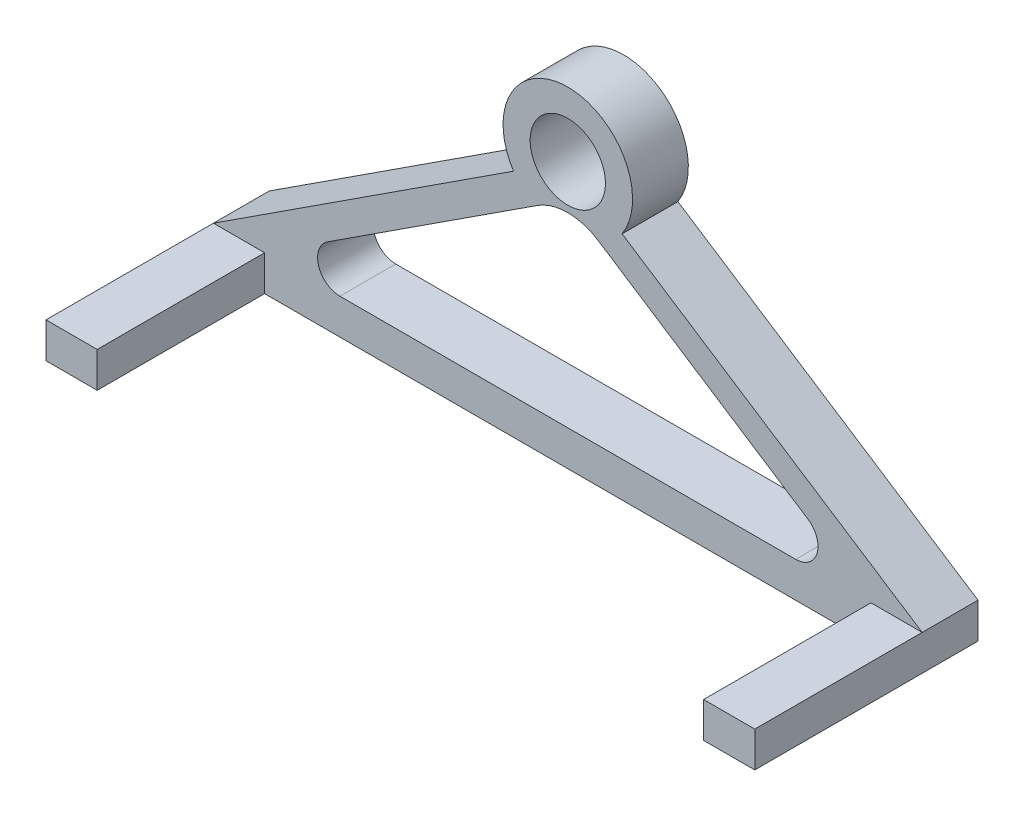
ISO-10303-21;
HEADER;
FILE_DESCRIPTION(('STEP AP214'),'2;1');
FILE_NAME('part.step','',(''),(''),'','','');
FILE_SCHEMA(('AUTOMOTIVE_DESIGN { 1 0 10303 214 1 1 1 1 }'));
ENDSEC;
DATA;
#1=APPLICATION_CONTEXT('core data for automotive mechanical design processes');
#2=APPLICATION_PROTOCOL_DEFINITION('international standard','automotive_design',2000,#1);
#3=PRODUCT_CONTEXT('',#1,'mechanical');
#4=PRODUCT('Part','Part','',(#3));
#5=PRODUCT_RELATED_PRODUCT_CATEGORY('part','',(#4));
#6=PRODUCT_DEFINITION_FORMATION('','',#4);
#7=PRODUCT_DEFINITION_CONTEXT('part definition',#1,'design');
#8=PRODUCT_DEFINITION('design','',#6,#7);
#9=PRODUCT_DEFINITION_SHAPE('','',#8);
#10=(LENGTH_UNIT() NAMED_UNIT(*) SI_UNIT(.MILLI.,.METRE.));
#11=(NAMED_UNIT(*) PLANE_ANGLE_UNIT() SI_UNIT($,.RADIAN.));
#12=(NAMED_UNIT(*) SI_UNIT($,.STERADIAN.) SOLID_ANGLE_UNIT());
#13=UNCERTAINTY_MEASURE_WITH_UNIT(LENGTH_MEASURE(1.E-05),#10,'distance_accuracy_value','');
#14=(GEOMETRIC_REPRESENTATION_CONTEXT(3) GLOBAL_UNCERTAINTY_ASSIGNED_CONTEXT((#13)) GLOBAL_UNIT_ASSIGNED_CONTEXT((#10,
#11,#12)) REPRESENTATION_CONTEXT('',''));
#15=CARTESIAN_POINT('',(0.,0.,0.));
#16=DIRECTION('',(0.,0.,1.));
#17=DIRECTION('',(1.,0.,0.));
#18=AXIS2_PLACEMENT_3D('',#15,#16,#17);
#19=CARTESIAN_POINT('',(0.,47.63,10.));
#20=DIRECTION('',(0.,0.,1.));
#21=DIRECTION('',(1.,0.,0.));
#22=AXIS2_PLACEMENT_3D('',#19,#20,#21);
#23=PLANE('',#22);
#24=DIRECTION('',(-1.,0.,0.));
#25=VECTOR('',#24,1.);
#26=CARTESIAN_POINT('',(-63.5,6.35,10.));
#27=LINE('',#26,#25);
#28=CARTESIAN_POINT('',(-54.3262731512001,6.35,10.));
#29=VERTEX_POINT('',#28);
#30=CARTESIAN_POINT('',(-63.5,6.35,10.));
#31=VERTEX_POINT('',#30);
#32=EDGE_CURVE('E195',#29,#31,#27,.T.);
#33=ORIENTED_EDGE('',*,*,#32,.F.);
#34=DIRECTION('',(0.,1.,0.));
#35=VECTOR('',#34,1.);
#36=CARTESIAN_POINT('',(-54.3262731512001,0.,10.));
#37=LINE('',#36,#35);
#38=CARTESIAN_POINT('',(-54.3262731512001,0.,10.));
#39=VERTEX_POINT('',#38);
#40=EDGE_CURVE('E164',#39,#29,#37,.T.);
#41=ORIENTED_EDGE('',*,*,#40,.F.);
#42=DIRECTION('',(1.,0.,0.));
#43=VECTOR('',#42,1.);
#44=CARTESIAN_POINT('',(-63.5,0.,10.));
#45=LINE('',#44,#43);
#46=CARTESIAN_POINT('',(54.3262731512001,0.,10.));
#47=VERTEX_POINT('',#46);
#48=EDGE_CURVE('E245',#39,#47,#45,.T.);
#49=ORIENTED_EDGE('',*,*,#48,.T.);
#50=DIRECTION('',(0.,1.,0.));
#51=VECTOR('',#50,1.);
#52=CARTESIAN_POINT('',(54.3262731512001,0.,10.));
#53=LINE('',#52,#51);
#54=CARTESIAN_POINT('',(54.3262731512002,6.34999999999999,10.));
#55=VERTEX_POINT('',#54);
#56=EDGE_CURVE('E175',#47,#55,#53,.T.);
#57=ORIENTED_EDGE('',*,*,#56,.T.);
#58=DIRECTION('',(1.,0.,0.));
#59=VECTOR('',#58,1.);
#60=CARTESIAN_POINT('',(63.5,6.35,10.));
#61=LINE('',#60,#59);
#62=CARTESIAN_POINT('',(63.5,6.35,10.));
#63=VERTEX_POINT('',#62);
#64=EDGE_CURVE('E185',#55,#63,#61,.T.);
#65=ORIENTED_EDGE('',*,*,#64,.T.);
#66=DIRECTION('',(-0.83841344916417,0.545034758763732,0.));
#67=VECTOR('',#66,1.);
#68=CARTESIAN_POINT('',(9.72559601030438,41.3075967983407,10.));
#69=LINE('',#68,#67);
#70=CARTESIAN_POINT('',(9.72559601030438,41.3075967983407,10.));
#71=VERTEX_POINT('',#70);
#72=EDGE_CURVE('E242',#63,#71,#69,.T.);
#73=ORIENTED_EDGE('',*,*,#72,.T.);
#74=CARTESIAN_POINT('',(0.,47.63,10.));
#75=DIRECTION('',(0.,0.,1.));
#76=DIRECTION('',(1.,0.,0.));
#77=AXIS2_PLACEMENT_3D('',#74,#75,#76);
#78=CIRCLE('',#77,11.6);
#79=CARTESIAN_POINT('',(-9.72559601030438,41.3075967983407,10.));
#80=VERTEX_POINT('',#79);
#81=EDGE_CURVE('E534',#71,#80,#78,.T.);
#82=ORIENTED_EDGE('',*,*,#81,.T.);
#83=DIRECTION('',(-0.83841344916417,-0.545034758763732,0.));
#84=VECTOR('',#83,1.);
#85=CARTESIAN_POINT('',(-9.72559601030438,41.3075967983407,10.));
#86=LINE('',#85,#84);
#87=EDGE_CURVE('E523',#80,#31,#86,.T.);
#88=ORIENTED_EDGE('',*,*,#87,.T.);
#89=EDGE_LOOP('',(#33,#41,#49,#57,#65,#73,#82,#88));
#90=FACE_BOUND('',#89,.T.);
#91=CARTESIAN_POINT('',(-40.8341908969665,10.35,10.));
#92=DIRECTION('',(0.,0.,1.));
#93=DIRECTION('',(1.,0.,0.));
#94=AXIS2_PLACEMENT_3D('',#91,#92,#93);
#95=CIRCLE('',#94,4.);
#96=CARTESIAN_POINT('',(-40.8341908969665,6.35,10.));
#97=VERTEX_POINT('',#96);
#98=CARTESIAN_POINT('',(-43.0143299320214,13.7036537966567,10.));
#99=VERTEX_POINT('',#98);
#100=EDGE_CURVE('E11',#97,#99,#95,.F.);
#101=ORIENTED_EDGE('',*,*,#100,.T.);
#102=DIRECTION('',(-0.83841344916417,-0.545034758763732,0.));
#103=VECTOR('',#102,1.);
#104=CARTESIAN_POINT('',(-5.45034758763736,38.1232001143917,10.));
#105=LINE('',#104,#103);
#106=CARTESIAN_POINT('',(-5.45034758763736,38.1232001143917,10.));
#107=VERTEX_POINT('',#106);
#108=EDGE_CURVE('E45',#107,#99,#105,.T.);
#109=ORIENTED_EDGE('',*,*,#108,.F.);
#110=CARTESIAN_POINT('',(0.,29.73906562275,10.));
#111=DIRECTION('',(0.,0.,1.));
#112=DIRECTION('',(1.,0.,0.));
#113=AXIS2_PLACEMENT_3D('',#110,#111,#112);
#114=CIRCLE('',#113,10.);
#115=CARTESIAN_POINT('',(5.45034758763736,38.1232001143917,10.));
#116=VERTEX_POINT('',#115);
#117=EDGE_CURVE('E217',#116,#107,#114,.T.);
#118=ORIENTED_EDGE('',*,*,#117,.F.);
#119=DIRECTION('',(-0.83841344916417,0.545034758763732,0.));
#120=VECTOR('',#119,1.);
#121=CARTESIAN_POINT('',(5.45034758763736,38.1232001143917,10.));
#122=LINE('',#121,#120);
#123=CARTESIAN_POINT('',(43.0143299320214,13.7036537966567,10.));
#124=VERTEX_POINT('',#123);
#125=EDGE_CURVE('E222',#124,#116,#122,.T.);
#126=ORIENTED_EDGE('',*,*,#125,.F.);
#127=CARTESIAN_POINT('',(40.8341908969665,10.35,10.));
#128=DIRECTION('',(0.,0.,1.));
#129=DIRECTION('',(1.,0.,0.));
#130=AXIS2_PLACEMENT_3D('',#127,#128,#129);
#131=CIRCLE('',#130,4.);
#132=CARTESIAN_POINT('',(40.8341908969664,6.34999999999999,10.));
#133=VERTEX_POINT('',#132);
#134=EDGE_CURVE('E269',#124,#133,#131,.F.);
#135=ORIENTED_EDGE('',*,*,#134,.T.);
#136=DIRECTION('',(1.,0.,0.));
#137=VECTOR('',#136,1.);
#138=CARTESIAN_POINT('',(-54.3262731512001,6.35,10.));
#139=LINE('',#138,#137);
#140=EDGE_CURVE('E52',#97,#133,#139,.T.);
#141=ORIENTED_EDGE('',*,*,#140,.F.);
#142=EDGE_LOOP('',(#101,#109,#118,#126,#135,#141));
#143=FACE_BOUND('',#142,.T.);
#144=CARTESIAN_POINT('',(0.,47.63,10.));
#145=DIRECTION('',(0.,0.,1.));
#146=DIRECTION('',(1.,0.,0.));
#147=AXIS2_PLACEMENT_3D('',#144,#145,#146);
#148=CIRCLE('',#147,6.745);
#149=CARTESIAN_POINT('',(6.745,47.63,10.));
#150=VERTEX_POINT('',#149);
#151=EDGE_CURVE('E210',#150,#150,#148,.T.);
#152=ORIENTED_EDGE('',*,*,#151,.F.);
#153=EDGE_LOOP('',(#152));
#154=FACE_BOUND('',#153,.T.);
#155=ADVANCED_FACE('F30',(#90,#143,#154),#23,.T.);
#156=CARTESIAN_POINT('',(0.,47.63,0.));
#157=DIRECTION('',(0.,0.,1.));
#158=DIRECTION('',(1.,0.,0.));
#159=AXIS2_PLACEMENT_3D('',#156,#157,#158);
#160=PLANE('',#159);
#161=CARTESIAN_POINT('',(0.,29.73906562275,0.));
#162=DIRECTION('',(0.,0.,1.));
#163=DIRECTION('',(1.,0.,0.));
#164=AXIS2_PLACEMENT_3D('',#161,#162,#163);
#165=CIRCLE('',#164,10.);
#166=CARTESIAN_POINT('',(5.45034758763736,38.1232001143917,0.));
#167=VERTEX_POINT('',#166);
#168=CARTESIAN_POINT('',(-5.45034758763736,38.1232001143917,0.));
#169=VERTEX_POINT('',#168);
#170=EDGE_CURVE('E213',#167,#169,#165,.T.);
#171=ORIENTED_EDGE('',*,*,#170,.T.);
#172=DIRECTION('',(-0.83841344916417,-0.545034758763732,0.));
#173=VECTOR('',#172,1.);
#174=CARTESIAN_POINT('',(-5.45034758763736,38.1232001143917,0.));
#175=LINE('',#174,#173);
#176=CARTESIAN_POINT('',(-43.0143299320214,13.7036537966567,0.));
#177=VERTEX_POINT('',#176);
#178=EDGE_CURVE('E227',#169,#177,#175,.T.);
#179=ORIENTED_EDGE('',*,*,#178,.T.);
#180=CARTESIAN_POINT('',(-40.8341908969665,10.35,0.));
#181=DIRECTION('',(0.,0.,1.));
#182=DIRECTION('',(1.,0.,0.));
#183=AXIS2_PLACEMENT_3D('',#180,#181,#182);
#184=CIRCLE('',#183,4.);
#185=CARTESIAN_POINT('',(-40.8341908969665,6.35,0.));
#186=VERTEX_POINT('',#185);
#187=EDGE_CURVE('E38',#177,#186,#184,.T.);
#188=ORIENTED_EDGE('',*,*,#187,.T.);
#189=DIRECTION('',(1.,0.,0.));
#190=VECTOR('',#189,1.);
#191=CARTESIAN_POINT('',(-54.3262731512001,6.35,0.));
#192=LINE('',#191,#190);
#193=CARTESIAN_POINT('',(40.8341908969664,6.34999999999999,0.));
#194=VERTEX_POINT('',#193);
#195=EDGE_CURVE('E230',#186,#194,#192,.T.);
#196=ORIENTED_EDGE('',*,*,#195,.T.);
#197=CARTESIAN_POINT('',(40.8341908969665,10.35,0.));
#198=DIRECTION('',(0.,0.,1.));
#199=DIRECTION('',(1.,0.,0.));
#200=AXIS2_PLACEMENT_3D('',#197,#198,#199);
#201=CIRCLE('',#200,4.);
#202=CARTESIAN_POINT('',(43.0143299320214,13.7036537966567,0.));
#203=VERTEX_POINT('',#202);
#204=EDGE_CURVE('E267',#194,#203,#201,.T.);
#205=ORIENTED_EDGE('',*,*,#204,.T.);
#206=DIRECTION('',(-0.83841344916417,0.545034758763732,0.));
#207=VECTOR('',#206,1.);
#208=CARTESIAN_POINT('',(5.45034758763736,38.1232001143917,0.));
#209=LINE('',#208,#207);
#210=EDGE_CURVE('E219',#203,#167,#209,.T.);
#211=ORIENTED_EDGE('',*,*,#210,.T.);
#212=EDGE_LOOP('',(#171,#179,#188,#196,#205,#211));
#213=FACE_BOUND('',#212,.T.);
#214=DIRECTION('',(0.,-1.,0.));
#215=VECTOR('',#214,1.);
#216=CARTESIAN_POINT('',(-63.5,6.35,0.));
#217=LINE('',#216,#215);
#218=CARTESIAN_POINT('',(-63.5,6.35,0.));
#219=VERTEX_POINT('',#218);
#220=CARTESIAN_POINT('',(-63.5,0.,0.));
#221=VERTEX_POINT('',#220);
#222=EDGE_CURVE('E239',#219,#221,#217,.T.);
#223=ORIENTED_EDGE('',*,*,#222,.F.);
#224=DIRECTION('',(-0.83841344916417,-0.545034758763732,0.));
#225=VECTOR('',#224,1.);
#226=CARTESIAN_POINT('',(-9.72559601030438,41.3075967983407,0.));
#227=LINE('',#226,#225);
#228=CARTESIAN_POINT('',(-9.72559601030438,41.3075967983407,0.));
#229=VERTEX_POINT('',#228);
#230=EDGE_CURVE('E248',#229,#219,#227,.T.);
#231=ORIENTED_EDGE('',*,*,#230,.F.);
#232=CARTESIAN_POINT('',(0.,47.63,0.));
#233=DIRECTION('',(0.,0.,1.));
#234=DIRECTION('',(1.,0.,0.));
#235=AXIS2_PLACEMENT_3D('',#232,#233,#234);
#236=CIRCLE('',#235,11.6);
#237=CARTESIAN_POINT('',(9.72559601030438,41.3075967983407,0.));
#238=VERTEX_POINT('',#237);
#239=EDGE_CURVE('E525',#238,#229,#236,.T.);
#240=ORIENTED_EDGE('',*,*,#239,.F.);
#241=DIRECTION('',(-0.83841344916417,0.545034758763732,0.));
#242=VECTOR('',#241,1.);
#243=CARTESIAN_POINT('',(9.72559601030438,41.3075967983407,0.));
#244=LINE('',#243,#242);
#245=CARTESIAN_POINT('',(63.5,6.35,0.));
#246=VERTEX_POINT('',#245);
#247=EDGE_CURVE('E527',#246,#238,#244,.T.);
#248=ORIENTED_EDGE('',*,*,#247,.F.);
#249=DIRECTION('',(0.,1.,0.));
#250=VECTOR('',#249,1.);
#251=CARTESIAN_POINT('',(63.5,6.35,0.));
#252=LINE('',#251,#250);
#253=CARTESIAN_POINT('',(63.5,0.,0.));
#254=VERTEX_POINT('',#253);
#255=EDGE_CURVE('E529',#254,#246,#252,.T.);
#256=ORIENTED_EDGE('',*,*,#255,.F.);
#257=DIRECTION('',(1.,0.,0.));
#258=VECTOR('',#257,1.);
#259=CARTESIAN_POINT('',(-63.5,0.,0.));
#260=LINE('',#259,#258);
#261=EDGE_CURVE('E510',#221,#254,#260,.T.);
#262=ORIENTED_EDGE('',*,*,#261,.F.);
#263=EDGE_LOOP('',(#223,#231,#240,#248,#256,#262));
#264=FACE_BOUND('',#263,.T.);
#265=CARTESIAN_POINT('',(0.,47.63,0.));
#266=DIRECTION('',(0.,0.,1.));
#267=DIRECTION('',(1.,0.,0.));
#268=AXIS2_PLACEMENT_3D('',#265,#266,#267);
#269=CIRCLE('',#268,6.745);
#270=CARTESIAN_POINT('',(6.745,47.63,0.));
#271=VERTEX_POINT('',#270);
#272=EDGE_CURVE('E214',#271,#271,#269,.T.);
#273=ORIENTED_EDGE('',*,*,#272,.T.);
#274=EDGE_LOOP('',(#273));
#275=FACE_BOUND('',#274,.T.);
#276=ADVANCED_FACE('F272',(#213,#264,#275),#160,.F.);
#277=CARTESIAN_POINT('',(-63.5,6.35,10.));
#278=DIRECTION('',(1.,0.,0.));
#279=DIRECTION('',(0.,0.,-1.));
#280=AXIS2_PLACEMENT_3D('',#277,#278,#279);
#281=PLANE('',#280);
#282=ORIENTED_EDGE('',*,*,#222,.T.);
#283=DIRECTION('',(0.,0.,-1.));
#284=VECTOR('',#283,1.);
#285=CARTESIAN_POINT('',(-63.5,0.,10.));
#286=LINE('',#285,#284);
#287=CARTESIAN_POINT('',(-63.5,0.,40.));
#288=VERTEX_POINT('',#287);
#289=EDGE_CURVE('E249',#288,#221,#286,.T.);
#290=ORIENTED_EDGE('',*,*,#289,.F.);
#291=DIRECTION('',(0.,-1.,0.));
#292=VECTOR('',#291,1.);
#293=CARTESIAN_POINT('',(-63.5,0.,40.));
#294=LINE('',#293,#292);
#295=CARTESIAN_POINT('',(-63.5,6.35,40.));
#296=VERTEX_POINT('',#295);
#297=EDGE_CURVE('E191',#296,#288,#294,.T.);
#298=ORIENTED_EDGE('',*,*,#297,.F.);
#299=DIRECTION('',(0.,0.,-1.));
#300=VECTOR('',#299,1.);
#301=CARTESIAN_POINT('',(-63.5,6.35,40.));
#302=LINE('',#301,#300);
#303=EDGE_CURVE('E201',#296,#31,#302,.T.);
#304=ORIENTED_EDGE('',*,*,#303,.T.);
#305=DIRECTION('',(0.,0.,-1.));
#306=VECTOR('',#305,1.);
#307=CARTESIAN_POINT('',(-63.5,6.35,10.));
#308=LINE('',#307,#306);
#309=EDGE_CURVE('E520',#31,#219,#308,.T.);
#310=ORIENTED_EDGE('',*,*,#309,.T.);
#311=EDGE_LOOP('',(#282,#290,#298,#304,#310));
#312=FACE_BOUND('',#311,.T.);
#313=ADVANCED_FACE('F311',(#312),#281,.F.);
#314=CARTESIAN_POINT('',(-63.5,0.,10.));
#315=DIRECTION('',(0.,1.,0.));
#316=DIRECTION('',(0.,0.,1.));
#317=AXIS2_PLACEMENT_3D('',#314,#315,#316);
#318=PLANE('',#317);
#319=ORIENTED_EDGE('',*,*,#261,.T.);
#320=DIRECTION('',(0.,0.,-1.));
#321=VECTOR('',#320,1.);
#322=CARTESIAN_POINT('',(63.5,0.,10.));
#323=LINE('',#322,#321);
#324=CARTESIAN_POINT('',(63.5,0.,40.));
#325=VERTEX_POINT('',#324);
#326=EDGE_CURVE('E509',#325,#254,#323,.T.);
#327=ORIENTED_EDGE('',*,*,#326,.F.);
#328=DIRECTION('',(-1.,0.,0.));
#329=VECTOR('',#328,1.);
#330=CARTESIAN_POINT('',(63.5,0.,40.));
#331=LINE('',#330,#329);
#332=CARTESIAN_POINT('',(54.3262731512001,0.,40.));
#333=VERTEX_POINT('',#332);
#334=EDGE_CURVE('E174',#325,#333,#331,.T.);
#335=ORIENTED_EDGE('',*,*,#334,.T.);
#336=DIRECTION('',(0.,0.,-1.));
#337=VECTOR('',#336,1.);
#338=CARTESIAN_POINT('',(54.3262731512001,0.,40.));
#339=LINE('',#338,#337);
#340=EDGE_CURVE('E184',#333,#47,#339,.T.);
#341=ORIENTED_EDGE('',*,*,#340,.T.);
#342=ORIENTED_EDGE('',*,*,#48,.F.);
#343=DIRECTION('',(0.,0.,-1.));
#344=VECTOR('',#343,1.);
#345=CARTESIAN_POINT('',(-54.3262731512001,0.,40.));
#346=LINE('',#345,#344);
#347=CARTESIAN_POINT('',(-54.3262731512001,0.,40.));
#348=VERTEX_POINT('',#347);
#349=EDGE_CURVE('E209',#348,#39,#346,.T.);
#350=ORIENTED_EDGE('',*,*,#349,.F.);
#351=DIRECTION('',(1.,0.,0.));
#352=VECTOR('',#351,1.);
#353=CARTESIAN_POINT('',(-63.5,0.,40.));
#354=LINE('',#353,#352);
#355=EDGE_CURVE('E194',#288,#348,#354,.T.);
#356=ORIENTED_EDGE('',*,*,#355,.F.);
#357=ORIENTED_EDGE('',*,*,#289,.T.);
#358=EDGE_LOOP('',(#319,#327,#335,#341,#342,#350,#356,#357));
#359=FACE_BOUND('',#358,.T.);
#360=ADVANCED_FACE('F327',(#359),#318,.F.);
#361=CARTESIAN_POINT('',(63.5,6.35,10.));
#362=DIRECTION('',(-1.,0.,0.));
#363=DIRECTION('',(0.,0.,1.));
#364=AXIS2_PLACEMENT_3D('',#361,#362,#363);
#365=PLANE('',#364);
#366=ORIENTED_EDGE('',*,*,#255,.T.);
#367=DIRECTION('',(0.,0.,-1.));
#368=VECTOR('',#367,1.);
#369=CARTESIAN_POINT('',(63.5,6.35,10.));
#370=LINE('',#369,#368);
#371=EDGE_CURVE('E159',#63,#246,#370,.T.);
#372=ORIENTED_EDGE('',*,*,#371,.F.);
#373=DIRECTION('',(0.,0.,-1.));
#374=VECTOR('',#373,1.);
#375=CARTESIAN_POINT('',(63.5,6.35,40.));
#376=LINE('',#375,#374);
#377=CARTESIAN_POINT('',(63.5,6.35,40.));
#378=VERTEX_POINT('',#377);
#379=EDGE_CURVE('E152',#378,#63,#376,.T.);
#380=ORIENTED_EDGE('',*,*,#379,.F.);
#381=DIRECTION('',(0.,-1.,0.));
#382=VECTOR('',#381,1.);
#383=CARTESIAN_POINT('',(63.5,0.,40.));
#384=LINE('',#383,#382);
#385=EDGE_CURVE('E156',#378,#325,#384,.T.);
#386=ORIENTED_EDGE('',*,*,#385,.T.);
#387=ORIENTED_EDGE('',*,*,#326,.T.);
#388=EDGE_LOOP('',(#366,#372,#380,#386,#387));
#389=FACE_BOUND('',#388,.T.);
#390=ADVANCED_FACE('F154',(#389),#365,.F.);
#391=CARTESIAN_POINT('',(9.72559601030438,41.3075967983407,10.));
#392=DIRECTION('',(-0.545034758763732,-0.83841344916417,0.));
#393=DIRECTION('',(0.83841344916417,-0.545034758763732,0.));
#394=AXIS2_PLACEMENT_3D('',#391,#392,#393);
#395=PLANE('',#394);
#396=ORIENTED_EDGE('',*,*,#247,.T.);
#397=DIRECTION('',(0.,0.,-1.));
#398=VECTOR('',#397,1.);
#399=CARTESIAN_POINT('',(9.72559601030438,41.3075967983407,10.));
#400=LINE('',#399,#398);
#401=EDGE_CURVE('E512',#71,#238,#400,.T.);
#402=ORIENTED_EDGE('',*,*,#401,.F.);
#403=ORIENTED_EDGE('',*,*,#72,.F.);
#404=ORIENTED_EDGE('',*,*,#371,.T.);
#405=EDGE_LOOP('',(#396,#402,#403,#404));
#406=FACE_BOUND('',#405,.T.);
#407=ADVANCED_FACE('F320',(#406),#395,.F.);
#408=CARTESIAN_POINT('',(0.,47.63,10.));
#409=DIRECTION('',(0.,0.,-1.));
#410=DIRECTION('',(-1.,0.,0.));
#411=AXIS2_PLACEMENT_3D('',#408,#409,#410);
#412=CYLINDRICAL_SURFACE('',#411,11.6);
#413=ORIENTED_EDGE('',*,*,#239,.T.);
#414=DIRECTION('',(0.,0.,-1.));
#415=VECTOR('',#414,1.);
#416=CARTESIAN_POINT('',(-9.72559601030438,41.3075967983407,10.));
#417=LINE('',#416,#415);
#418=EDGE_CURVE('E517',#80,#229,#417,.T.);
#419=ORIENTED_EDGE('',*,*,#418,.F.);
#420=ORIENTED_EDGE('',*,*,#81,.F.);
#421=ORIENTED_EDGE('',*,*,#401,.T.);
#422=EDGE_LOOP('',(#413,#419,#420,#421));
#423=FACE_BOUND('',#422,.T.);
#424=ADVANCED_FACE('F316',(#423),#412,.T.);
#425=CARTESIAN_POINT('',(-9.72559601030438,41.3075967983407,10.));
#426=DIRECTION('',(0.545034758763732,-0.83841344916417,0.));
#427=DIRECTION('',(0.83841344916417,0.545034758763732,0.));
#428=AXIS2_PLACEMENT_3D('',#425,#426,#427);
#429=PLANE('',#428);
#430=ORIENTED_EDGE('',*,*,#230,.T.);
#431=ORIENTED_EDGE('',*,*,#309,.F.);
#432=ORIENTED_EDGE('',*,*,#87,.F.);
#433=ORIENTED_EDGE('',*,*,#418,.T.);
#434=EDGE_LOOP('',(#430,#431,#432,#433));
#435=FACE_BOUND('',#434,.T.);
#436=ADVANCED_FACE('F303',(#435),#429,.F.);
#437=CARTESIAN_POINT('',(0.,29.73906562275,10.));
#438=DIRECTION('',(0.,0.,-1.));
#439=DIRECTION('',(-1.,0.,0.));
#440=AXIS2_PLACEMENT_3D('',#437,#438,#439);
#441=CYLINDRICAL_SURFACE('',#440,10.);
#442=ORIENTED_EDGE('',*,*,#170,.F.);
#443=DIRECTION('',(0.,0.,-1.));
#444=VECTOR('',#443,1.);
#445=CARTESIAN_POINT('',(5.45034758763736,38.1232001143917,10.));
#446=LINE('',#445,#444);
#447=EDGE_CURVE('E224',#116,#167,#446,.T.);
#448=ORIENTED_EDGE('',*,*,#447,.F.);
#449=ORIENTED_EDGE('',*,*,#117,.T.);
#450=DIRECTION('',(0.,0.,-1.));
#451=VECTOR('',#450,1.);
#452=CARTESIAN_POINT('',(-5.45034758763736,38.1232001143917,10.));
#453=LINE('',#452,#451);
#454=EDGE_CURVE('E236',#107,#169,#453,.T.);
#455=ORIENTED_EDGE('',*,*,#454,.T.);
#456=EDGE_LOOP('',(#442,#448,#449,#455));
#457=FACE_BOUND('',#456,.T.);
#458=ADVANCED_FACE('F294',(#457),#441,.F.);
#459=CARTESIAN_POINT('',(-5.45034758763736,38.1232001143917,10.));
#460=DIRECTION('',(0.545034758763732,-0.83841344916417,0.));
#461=DIRECTION('',(0.83841344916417,0.545034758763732,0.));
#462=AXIS2_PLACEMENT_3D('',#459,#460,#461);
#463=PLANE('',#462);
#464=ORIENTED_EDGE('',*,*,#108,.T.);
#465=DIRECTION('',(0.,0.,-1.));
#466=VECTOR('',#465,1.);
#467=CARTESIAN_POINT('',(-43.0143299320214,13.7036537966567,0.));
#468=LINE('',#467,#466);
#469=EDGE_CURVE('E265',#99,#177,#468,.T.);
#470=ORIENTED_EDGE('',*,*,#469,.T.);
#471=ORIENTED_EDGE('',*,*,#178,.F.);
#472=ORIENTED_EDGE('',*,*,#454,.F.);
#473=EDGE_LOOP('',(#464,#470,#471,#472));
#474=FACE_BOUND('',#473,.T.);
#475=ADVANCED_FACE('F295',(#474),#463,.T.);
#476=CARTESIAN_POINT('',(-54.3262731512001,6.35,10.));
#477=DIRECTION('',(0.,1.,0.));
#478=DIRECTION('',(-1.,0.,0.));
#479=AXIS2_PLACEMENT_3D('',#476,#477,#478);
#480=PLANE('',#479);
#481=ORIENTED_EDGE('',*,*,#140,.T.);
#482=DIRECTION('',(0.,0.,-1.));
#483=VECTOR('',#482,1.);
#484=CARTESIAN_POINT('',(40.8341908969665,6.34999999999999,0.));
#485=LINE('',#484,#483);
#486=EDGE_CURVE('E261',#133,#194,#485,.T.);
#487=ORIENTED_EDGE('',*,*,#486,.T.);
#488=ORIENTED_EDGE('',*,*,#195,.F.);
#489=DIRECTION('',(0.,0.,-1.));
#490=VECTOR('',#489,1.);
#491=CARTESIAN_POINT('',(-40.8341908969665,6.35,10.));
#492=LINE('',#491,#490);
#493=EDGE_CURVE('E259',#186,#97,#492,.F.);
#494=ORIENTED_EDGE('',*,*,#493,.T.);
#495=EDGE_LOOP('',(#481,#487,#488,#494));
#496=FACE_BOUND('',#495,.T.);
#497=ADVANCED_FACE('F277',(#496),#480,.T.);
#498=CARTESIAN_POINT('',(5.45034758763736,38.1232001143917,10.));
#499=DIRECTION('',(-0.545034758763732,-0.83841344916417,0.));
#500=DIRECTION('',(0.83841344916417,-0.545034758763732,0.));
#501=AXIS2_PLACEMENT_3D('',#498,#499,#500);
#502=PLANE('',#501);
#503=ORIENTED_EDGE('',*,*,#210,.F.);
#504=DIRECTION('',(0.,0.,-1.));
#505=VECTOR('',#504,1.);
#506=CARTESIAN_POINT('',(43.0143299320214,13.7036537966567,10.));
#507=LINE('',#506,#505);
#508=EDGE_CURVE('E263',#203,#124,#507,.F.);
#509=ORIENTED_EDGE('',*,*,#508,.T.);
#510=ORIENTED_EDGE('',*,*,#125,.T.);
#511=ORIENTED_EDGE('',*,*,#447,.T.);
#512=EDGE_LOOP('',(#503,#509,#510,#511));
#513=FACE_BOUND('',#512,.T.);
#514=ADVANCED_FACE('F291',(#513),#502,.T.);
#515=CARTESIAN_POINT('',(0.,47.63,10.));
#516=DIRECTION('',(0.,0.,-1.));
#517=DIRECTION('',(-1.,0.,0.));
#518=AXIS2_PLACEMENT_3D('',#515,#516,#517);
#519=CYLINDRICAL_SURFACE('',#518,6.745);
#520=ORIENTED_EDGE('',*,*,#151,.T.);
#521=EDGE_LOOP('',(#520));
#522=FACE_BOUND('',#521,.T.);
#523=ORIENTED_EDGE('',*,*,#272,.F.);
#524=EDGE_LOOP('',(#523));
#525=FACE_BOUND('',#524,.T.);
#526=ADVANCED_FACE('F359',(#522,#525),#519,.F.);
#527=CARTESIAN_POINT('',(-54.3262731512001,0.,40.));
#528=DIRECTION('',(-1.,0.,0.));
#529=DIRECTION('',(0.,0.,1.));
#530=AXIS2_PLACEMENT_3D('',#527,#528,#529);
#531=PLANE('',#530);
#532=ORIENTED_EDGE('',*,*,#40,.T.);
#533=DIRECTION('',(0.,0.,-1.));
#534=VECTOR('',#533,1.);
#535=CARTESIAN_POINT('',(-54.3262731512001,6.35,40.));
#536=LINE('',#535,#534);
#537=CARTESIAN_POINT('',(-54.3262731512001,6.35,40.));
#538=VERTEX_POINT('',#537);
#539=EDGE_CURVE('E206',#538,#29,#536,.T.);
#540=ORIENTED_EDGE('',*,*,#539,.F.);
#541=DIRECTION('',(0.,1.,0.));
#542=VECTOR('',#541,1.);
#543=CARTESIAN_POINT('',(-54.3262731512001,0.,40.));
#544=LINE('',#543,#542);
#545=EDGE_CURVE('E197',#348,#538,#544,.T.);
#546=ORIENTED_EDGE('',*,*,#545,.F.);
#547=ORIENTED_EDGE('',*,*,#349,.T.);
#548=EDGE_LOOP('',(#532,#540,#546,#547));
#549=FACE_BOUND('',#548,.T.);
#550=ADVANCED_FACE('F355',(#549),#531,.F.);
#551=CARTESIAN_POINT('',(-63.5,6.35,40.));
#552=DIRECTION('',(0.,-1.,0.));
#553=DIRECTION('',(0.,0.,-1.));
#554=AXIS2_PLACEMENT_3D('',#551,#552,#553);
#555=PLANE('',#554);
#556=ORIENTED_EDGE('',*,*,#32,.T.);
#557=ORIENTED_EDGE('',*,*,#303,.F.);
#558=DIRECTION('',(-1.,0.,0.));
#559=VECTOR('',#558,1.);
#560=CARTESIAN_POINT('',(-63.5,6.35,40.));
#561=LINE('',#560,#559);
#562=EDGE_CURVE('E199',#538,#296,#561,.T.);
#563=ORIENTED_EDGE('',*,*,#562,.F.);
#564=ORIENTED_EDGE('',*,*,#539,.T.);
#565=EDGE_LOOP('',(#556,#557,#563,#564));
#566=FACE_BOUND('',#565,.T.);
#567=ADVANCED_FACE('F351',(#566),#555,.F.);
#568=CARTESIAN_POINT('',(-63.5,6.35,40.));
#569=DIRECTION('',(0.,0.,-1.));
#570=DIRECTION('',(-1.,0.,0.));
#571=AXIS2_PLACEMENT_3D('',#568,#569,#570);
#572=PLANE('',#571);
#573=ORIENTED_EDGE('',*,*,#297,.T.);
#574=ORIENTED_EDGE('',*,*,#355,.T.);
#575=ORIENTED_EDGE('',*,*,#545,.T.);
#576=ORIENTED_EDGE('',*,*,#562,.T.);
#577=EDGE_LOOP('',(#573,#574,#575,#576));
#578=FACE_BOUND('',#577,.T.);
#579=ADVANCED_FACE('F348',(#578),#572,.F.);
#580=CARTESIAN_POINT('',(63.5,6.35,40.));
#581=DIRECTION('',(0.,1.,0.));
#582=DIRECTION('',(0.,0.,1.));
#583=AXIS2_PLACEMENT_3D('',#580,#581,#582);
#584=PLANE('',#583);
#585=ORIENTED_EDGE('',*,*,#64,.F.);
#586=DIRECTION('',(0.,0.,-1.));
#587=VECTOR('',#586,1.);
#588=CARTESIAN_POINT('',(54.3262731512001,6.35,40.));
#589=LINE('',#588,#587);
#590=CARTESIAN_POINT('',(54.3262731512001,6.35,40.));
#591=VERTEX_POINT('',#590);
#592=EDGE_CURVE('E165',#591,#55,#589,.T.);
#593=ORIENTED_EDGE('',*,*,#592,.F.);
#594=DIRECTION('',(1.,0.,0.));
#595=VECTOR('',#594,1.);
#596=CARTESIAN_POINT('',(63.5,6.35,40.));
#597=LINE('',#596,#595);
#598=EDGE_CURVE('E171',#591,#378,#597,.T.);
#599=ORIENTED_EDGE('',*,*,#598,.T.);
#600=ORIENTED_EDGE('',*,*,#379,.T.);
#601=EDGE_LOOP('',(#585,#593,#599,#600));
#602=FACE_BOUND('',#601,.T.);
#603=ADVANCED_FACE('F177',(#602),#584,.T.);
#604=CARTESIAN_POINT('',(54.3262731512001,0.,40.));
#605=DIRECTION('',(-1.,0.,0.));
#606=DIRECTION('',(0.,0.,1.));
#607=AXIS2_PLACEMENT_3D('',#604,#605,#606);
#608=PLANE('',#607);
#609=ORIENTED_EDGE('',*,*,#56,.F.);
#610=ORIENTED_EDGE('',*,*,#340,.F.);
#611=DIRECTION('',(0.,1.,0.));
#612=VECTOR('',#611,1.);
#613=CARTESIAN_POINT('',(54.3262731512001,0.,40.));
#614=LINE('',#613,#612);
#615=EDGE_CURVE('E179',#333,#591,#614,.T.);
#616=ORIENTED_EDGE('',*,*,#615,.T.);
#617=ORIENTED_EDGE('',*,*,#592,.T.);
#618=EDGE_LOOP('',(#609,#610,#616,#617));
#619=FACE_BOUND('',#618,.T.);
#620=ADVANCED_FACE('F338',(#619),#608,.T.);
#621=CARTESIAN_POINT('',(63.5,6.35,40.));
#622=DIRECTION('',(0.,0.,-1.));
#623=DIRECTION('',(1.,0.,0.));
#624=AXIS2_PLACEMENT_3D('',#621,#622,#623);
#625=PLANE('',#624);
#626=ORIENTED_EDGE('',*,*,#385,.F.);
#627=ORIENTED_EDGE('',*,*,#598,.F.);
#628=ORIENTED_EDGE('',*,*,#615,.F.);
#629=ORIENTED_EDGE('',*,*,#334,.F.);
#630=EDGE_LOOP('',(#626,#627,#628,#629));
#631=FACE_BOUND('',#630,.T.);
#632=ADVANCED_FACE('F169',(#631),#625,.F.);
#633=CARTESIAN_POINT('',(40.8341908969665,10.35,10.));
#634=DIRECTION('',(0.,0.,1.));
#635=DIRECTION('',(1.,0.,0.));
#636=AXIS2_PLACEMENT_3D('',#633,#634,#635);
#637=CYLINDRICAL_SURFACE('',#636,4.);
#638=ORIENTED_EDGE('',*,*,#134,.F.);
#639=ORIENTED_EDGE('',*,*,#508,.F.);
#640=ORIENTED_EDGE('',*,*,#204,.F.);
#641=ORIENTED_EDGE('',*,*,#486,.F.);
#642=EDGE_LOOP('',(#638,#639,#640,#641));
#643=FACE_BOUND('',#642,.T.);
#644=ADVANCED_FACE('F287',(#643),#637,.F.);
#645=CARTESIAN_POINT('',(-40.8341908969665,10.35,10.));
#646=DIRECTION('',(0.,0.,1.));
#647=DIRECTION('',(1.,0.,0.));
#648=AXIS2_PLACEMENT_3D('',#645,#646,#647);
#649=CYLINDRICAL_SURFACE('',#648,4.);
#650=ORIENTED_EDGE('',*,*,#100,.F.);
#651=ORIENTED_EDGE('',*,*,#493,.F.);
#652=ORIENTED_EDGE('',*,*,#187,.F.);
#653=ORIENTED_EDGE('',*,*,#469,.F.);
#654=EDGE_LOOP('',(#650,#651,#652,#653));
#655=FACE_BOUND('',#654,.T.);
#656=ADVANCED_FACE('F32',(#655),#649,.F.);
#657=CLOSED_SHELL('',(#155,#276,#313,#360,#390,#407,#424,#436,#458,#475,#497,#514,#526,#550,
#567,#579,#603,#620,#632,#644,#656));
#658=MANIFOLD_SOLID_BREP('B2',#657);
#659=ADVANCED_BREP_SHAPE_REPRESENTATION('',(#18,#658),#14);
#660=SHAPE_DEFINITION_REPRESENTATION(#9,#659);
ENDSEC;
END-ISO-10303-21;
